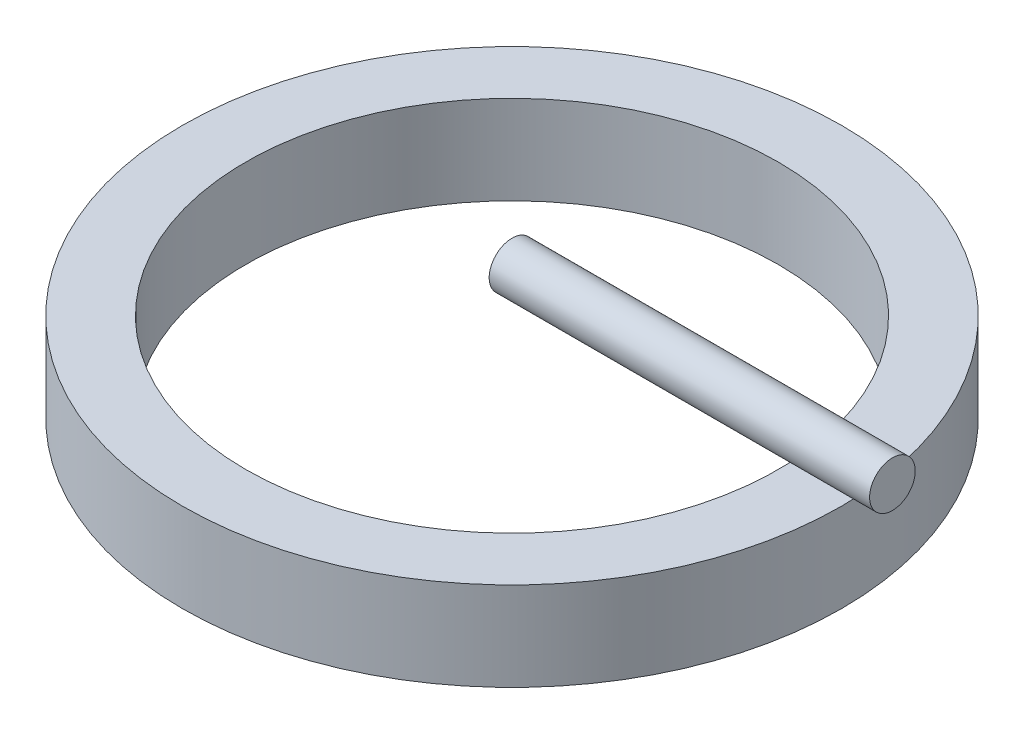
from build123d import *

# Parameters (mm, degrees)
SKETCH1_R           = 13000
SKETCH1_R_2         = 10500
BOSS_EXTRUDE1_DEPTH = 3500
SKETCH2_R           = 900
BOSS_EXTRUDE2_DEPTH = 15000


with BuildPart() as part:
    # Sketch1 → Boss-Extrude1 (new body)
    with BuildSketch(Plane(origin=(0, 0, 0), x_dir=(1, 0, 0), z_dir=(0, 1, 0))):
        with Locations(Location((0, 0, 0), (0, 0, 270))):
            Circle(SKETCH1_R)
        with Locations(Location((0, 0, 0), (0, 0, 270))):
            Circle(SKETCH1_R_2, mode=Mode.SUBTRACT)
    extrude(amount=-BOSS_EXTRUDE1_DEPTH)


with BuildPart() as body_2:
    # Sketch2 → Boss-Extrude2 (new body)
    with BuildSketch(Plane(origin=(0, 0, 0), x_dir=(0, 0, -1), z_dir=(1, 0, 0))):
        with Locations((0, 1750)):
            Circle(SKETCH2_R)
    extrude(amount=BOSS_EXTRUDE2_DEPTH)


solid = Compound([part.part, body_2.part])
